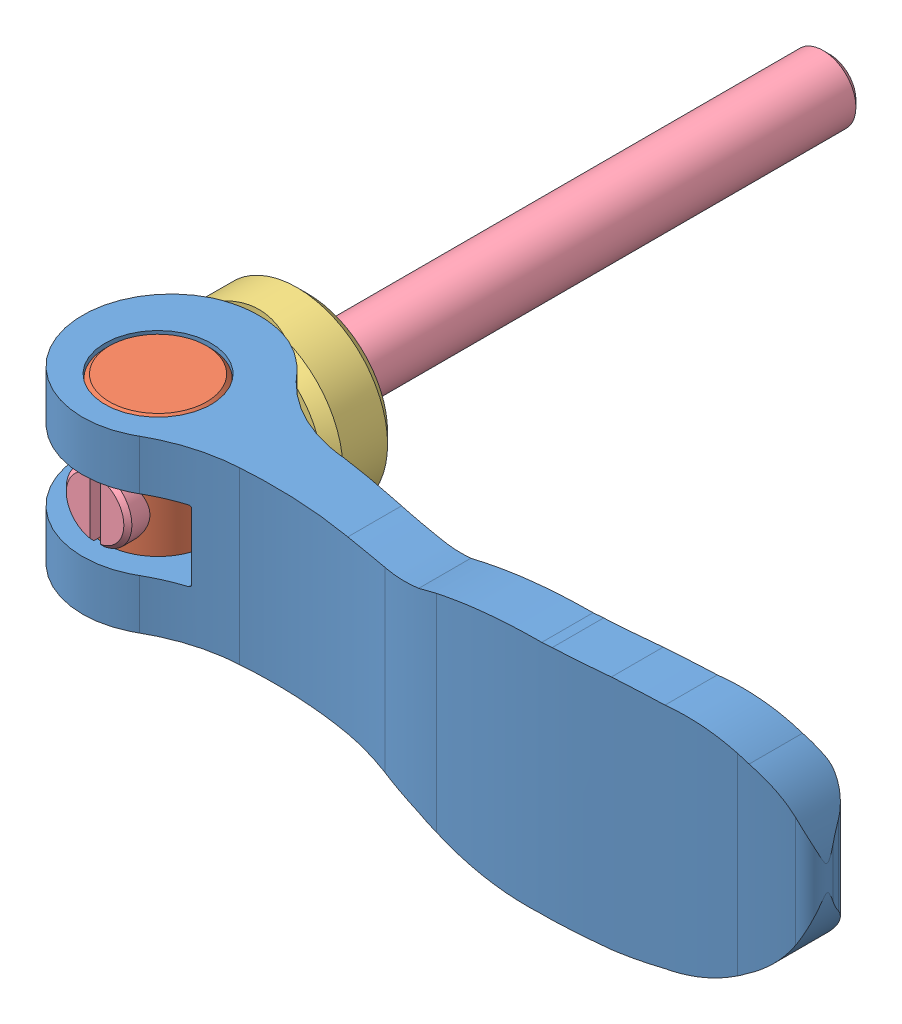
SolidWorks assembly KCL05AX40-SUS.SLDASM, configuration Default (file format 15000). Lengths in mm.
Overall size (59.2 18.05 57.01).
4 component instances, 4 part files, 0 mates.
Components (placement in the parent):
- KCL05AX40-SUS_01-1: KCL05AX40-SUS_01.SLDPRT [ﾃﾞﾌｫﾙﾄ] at (0 0 11.4) x (1 0 0) z (0 -1 0) size (59.1 13.57 18.05)
- KCL05AX40-SUS_02-1: KCL05AX40-SUS_02.SLDPRT [ﾃﾞﾌｫﾙﾄ] at (0 0 11.4) x (0 1 0) z (1 0 0) size (13 8 8)
- KCL05AX40-SUS_03-1: KCL05AX40-SUS_03.SLDPRT [ﾃﾞﾌｫﾙﾄ] x (1 0 0) z (0 -1 0) size (13.8 5.38 13.8)
- KCL05AX40-SUS_04-1: KCL05AX40-SUS_04.SLDPRT [ﾃﾞﾌｫﾙﾄ] at (0 0 -19.8) x (0 1 0) z (1 0 0) size (5 56 5)
